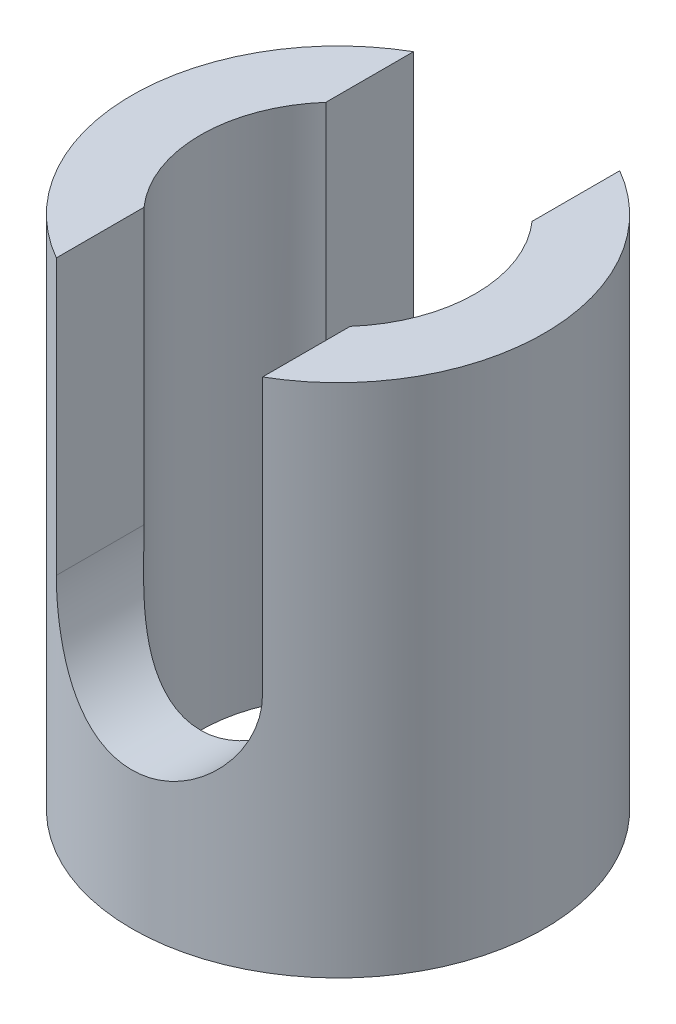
from build123d import *

# Parameters (mm, degrees)
SKETCH_1_R          = 30
SKETCH_1_R_2        = 20
EXTRUDE_1_DEPTH     = 75
CUT_EXTRUDE_2_DEPTH = 45


with BuildPart() as part:
    # Sketch 1 → Extrude 1 (new body)
    with BuildSketch(Plane(origin=(0, 0, 0), x_dir=(1, 0, 0), z_dir=(0, 1, 0))):
        with Locations(Location((0, 0, 0), (0, 0, 270))):
            Circle(SKETCH_1_R)
        with Locations(Location((0, 0, 0), (0, 0, 270))):
            Circle(SKETCH_1_R_2, mode=Mode.SUBTRACT)
    extrude(amount=EXTRUDE_1_DEPTH)

    # Sketch 4 → Cut-Extrude 2 (cut, symmetric)
    with BuildSketch(Plane.XY):
        with BuildLine():
            Line((-15, 75), (-15, 35))
            ThreePointArc((-15, 35), (0, 20), (15, 35))
            Line((15, 35), (15, 75))
            Line((15, 75), (-15, 75))
        make_face()
    extrude(amount=CUT_EXTRUDE_2_DEPTH, both=True, mode=Mode.SUBTRACT)


solid = part.part
